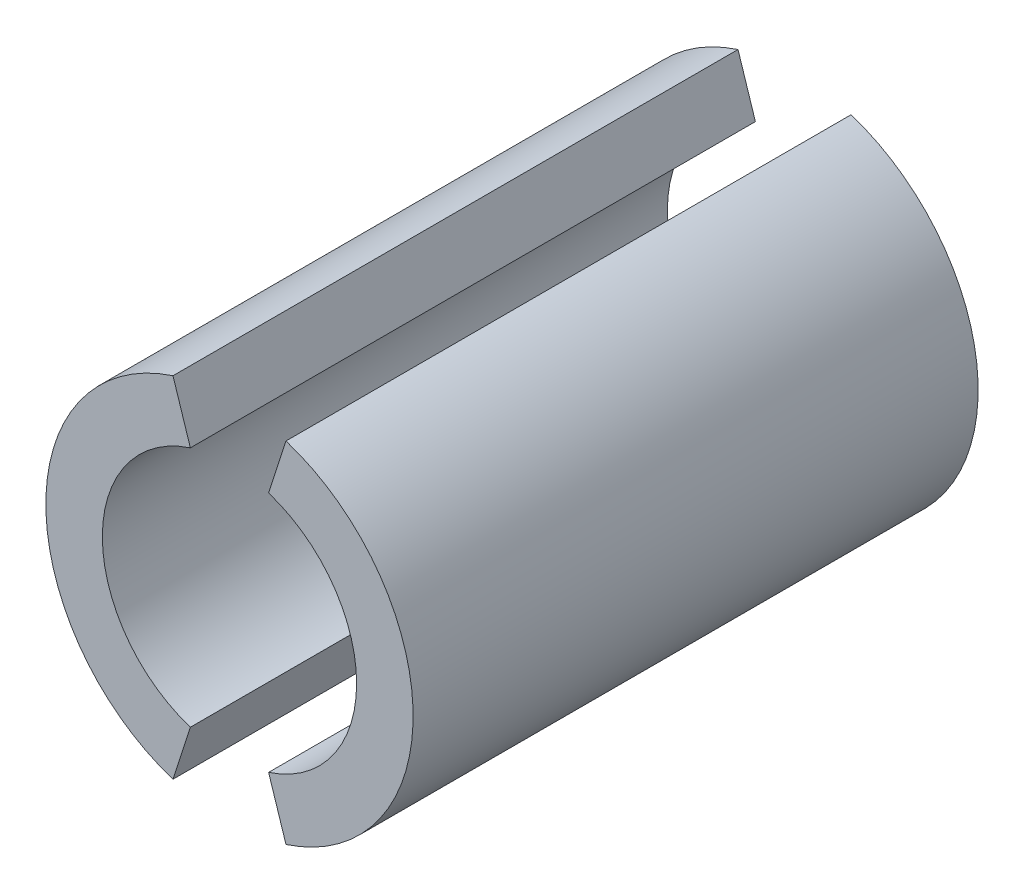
ISO-10303-21;
HEADER;
FILE_DESCRIPTION(('STEP AP214'),'2;1');
FILE_NAME('part.step','',(''),(''),'','','');
FILE_SCHEMA(('AUTOMOTIVE_DESIGN { 1 0 10303 214 1 1 1 1 }'));
ENDSEC;
DATA;
#1=APPLICATION_CONTEXT('core data for automotive mechanical design processes');
#2=APPLICATION_PROTOCOL_DEFINITION('international standard','automotive_design',2000,#1);
#3=PRODUCT_CONTEXT('',#1,'mechanical');
#4=PRODUCT('Part','Part','',(#3));
#5=PRODUCT_RELATED_PRODUCT_CATEGORY('part','',(#4));
#6=PRODUCT_DEFINITION_FORMATION('','',#4);
#7=PRODUCT_DEFINITION_CONTEXT('part definition',#1,'design');
#8=PRODUCT_DEFINITION('design','',#6,#7);
#9=PRODUCT_DEFINITION_SHAPE('','',#8);
#10=(LENGTH_UNIT() NAMED_UNIT(*) SI_UNIT(.MILLI.,.METRE.));
#11=(NAMED_UNIT(*) PLANE_ANGLE_UNIT() SI_UNIT($,.RADIAN.));
#12=(NAMED_UNIT(*) SI_UNIT($,.STERADIAN.) SOLID_ANGLE_UNIT());
#13=UNCERTAINTY_MEASURE_WITH_UNIT(LENGTH_MEASURE(1.E-05),#10,'distance_accuracy_value','');
#14=(GEOMETRIC_REPRESENTATION_CONTEXT(3) GLOBAL_UNCERTAINTY_ASSIGNED_CONTEXT((#13)) GLOBAL_UNIT_ASSIGNED_CONTEXT((#10,
#11,#12)) REPRESENTATION_CONTEXT('',''));
#15=CARTESIAN_POINT('',(0.,0.,0.));
#16=DIRECTION('',(0.,0.,1.));
#17=DIRECTION('',(1.,0.,0.));
#18=AXIS2_PLACEMENT_3D('',#15,#16,#17);
#19=CARTESIAN_POINT('',(0.,0.,-31.75));
#20=DIRECTION('',(0.,0.,1.));
#21=DIRECTION('',(1.,0.,0.));
#22=AXIS2_PLACEMENT_3D('',#19,#20,#21);
#23=CYLINDRICAL_SURFACE('',#22,14.2875);
#24=DIRECTION('',(0.,0.,1.));
#25=VECTOR('',#24,1.);
#26=CARTESIAN_POINT('',(4.39615384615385,-13.5943549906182,-31.75));
#27=LINE('',#26,#25);
#28=CARTESIAN_POINT('',(4.39615384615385,-13.5943549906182,-31.75));
#29=VERTEX_POINT('',#28);
#30=CARTESIAN_POINT('',(4.39615384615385,-13.5943549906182,31.75));
#31=VERTEX_POINT('',#30);
#32=EDGE_CURVE('E43',#29,#31,#27,.T.);
#33=ORIENTED_EDGE('',*,*,#32,.T.);
#34=CARTESIAN_POINT('',(0.,0.,31.75));
#35=DIRECTION('',(0.,0.,-1.));
#36=DIRECTION('',(1.,0.,0.));
#37=AXIS2_PLACEMENT_3D('',#34,#35,#36);
#38=CIRCLE('',#37,14.2875);
#39=CARTESIAN_POINT('',(4.39615384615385,13.5943549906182,31.75));
#40=VERTEX_POINT('',#39);
#41=EDGE_CURVE('E80',#40,#31,#38,.T.);
#42=ORIENTED_EDGE('',*,*,#41,.F.);
#43=DIRECTION('',(0.,0.,1.));
#44=VECTOR('',#43,1.);
#45=CARTESIAN_POINT('',(4.39615384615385,13.5943549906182,-31.75));
#46=LINE('',#45,#44);
#47=CARTESIAN_POINT('',(4.39615384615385,13.5943549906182,-31.75));
#48=VERTEX_POINT('',#47);
#49=EDGE_CURVE('E12',#48,#40,#46,.T.);
#50=ORIENTED_EDGE('',*,*,#49,.F.);
#51=CARTESIAN_POINT('',(0.,0.,-31.75));
#52=DIRECTION('',(0.,0.,-1.));
#53=DIRECTION('',(1.,0.,0.));
#54=AXIS2_PLACEMENT_3D('',#51,#52,#53);
#55=CIRCLE('',#54,14.2875);
#56=EDGE_CURVE('E81',#48,#29,#55,.T.);
#57=ORIENTED_EDGE('',*,*,#56,.T.);
#58=EDGE_LOOP('',(#33,#42,#50,#57));
#59=FACE_BOUND('',#58,.T.);
#60=ADVANCED_FACE('F40',(#59),#23,.F.);
#61=CARTESIAN_POINT('',(4.39615384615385,13.5943549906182,-31.75));
#62=DIRECTION('',(-0.951485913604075,0.307692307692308,0.));
#63=DIRECTION('',(-0.307692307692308,-0.951485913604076,0.));
#64=AXIS2_PLACEMENT_3D('',#61,#62,#63);
#65=PLANE('',#64);
#66=ORIENTED_EDGE('',*,*,#49,.T.);
#67=DIRECTION('',(-0.307692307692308,-0.951485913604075,0.));
#68=VECTOR('',#67,1.);
#69=CARTESIAN_POINT('',(4.39615384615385,13.5943549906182,31.75));
#70=LINE('',#69,#68);
#71=CARTESIAN_POINT('',(6.34999999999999,19.6362905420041,31.75));
#72=VERTEX_POINT('',#71);
#73=EDGE_CURVE('E97',#72,#40,#70,.T.);
#74=ORIENTED_EDGE('',*,*,#73,.F.);
#75=DIRECTION('',(0.,0.,1.));
#76=VECTOR('',#75,1.);
#77=CARTESIAN_POINT('',(6.34999999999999,19.6362905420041,-31.75));
#78=LINE('',#77,#76);
#79=CARTESIAN_POINT('',(6.34999999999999,19.6362905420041,-31.75));
#80=VERTEX_POINT('',#79);
#81=EDGE_CURVE('E48',#80,#72,#78,.T.);
#82=ORIENTED_EDGE('',*,*,#81,.F.);
#83=DIRECTION('',(-0.307692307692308,-0.951485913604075,0.));
#84=VECTOR('',#83,1.);
#85=CARTESIAN_POINT('',(4.39615384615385,13.5943549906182,-31.75));
#86=LINE('',#85,#84);
#87=EDGE_CURVE('E86',#80,#48,#86,.T.);
#88=ORIENTED_EDGE('',*,*,#87,.T.);
#89=EDGE_LOOP('',(#66,#74,#82,#88));
#90=FACE_BOUND('',#89,.T.);
#91=ADVANCED_FACE('F112',(#90),#65,.T.);
#92=CARTESIAN_POINT('',(0.,0.,-31.75));
#93=DIRECTION('',(0.,0.,1.));
#94=DIRECTION('',(1.,0.,0.));
#95=AXIS2_PLACEMENT_3D('',#92,#93,#94);
#96=CYLINDRICAL_SURFACE('',#95,20.6375);
#97=ORIENTED_EDGE('',*,*,#81,.T.);
#98=CARTESIAN_POINT('',(0.,0.,31.75));
#99=DIRECTION('',(0.,0.,1.));
#100=DIRECTION('',(1.,0.,0.));
#101=AXIS2_PLACEMENT_3D('',#98,#99,#100);
#102=CIRCLE('',#101,20.6375);
#103=CARTESIAN_POINT('',(6.35,-19.6362905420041,31.75));
#104=VERTEX_POINT('',#103);
#105=EDGE_CURVE('E93',#104,#72,#102,.T.);
#106=ORIENTED_EDGE('',*,*,#105,.F.);
#107=DIRECTION('',(0.,0.,1.));
#108=VECTOR('',#107,1.);
#109=CARTESIAN_POINT('',(6.35,-19.6362905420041,-31.75));
#110=LINE('',#109,#108);
#111=CARTESIAN_POINT('',(6.35,-19.6362905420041,-31.75));
#112=VERTEX_POINT('',#111);
#113=EDGE_CURVE('E85',#112,#104,#110,.T.);
#114=ORIENTED_EDGE('',*,*,#113,.F.);
#115=CARTESIAN_POINT('',(0.,0.,-31.75));
#116=DIRECTION('',(0.,0.,1.));
#117=DIRECTION('',(1.,0.,0.));
#118=AXIS2_PLACEMENT_3D('',#115,#116,#117);
#119=CIRCLE('',#118,20.6375);
#120=EDGE_CURVE('E105',#112,#80,#119,.T.);
#121=ORIENTED_EDGE('',*,*,#120,.T.);
#122=EDGE_LOOP('',(#97,#106,#114,#121));
#123=FACE_BOUND('',#122,.T.);
#124=ADVANCED_FACE('F109',(#123),#96,.T.);
#125=CARTESIAN_POINT('',(4.39615384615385,-13.5943549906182,-31.75));
#126=DIRECTION('',(-0.951485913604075,-0.307692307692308,0.));
#127=DIRECTION('',(0.307692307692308,-0.951485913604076,0.));
#128=AXIS2_PLACEMENT_3D('',#125,#126,#127);
#129=PLANE('',#128);
#130=ORIENTED_EDGE('',*,*,#113,.T.);
#131=DIRECTION('',(0.307692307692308,-0.951485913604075,0.));
#132=VECTOR('',#131,1.);
#133=CARTESIAN_POINT('',(4.39615384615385,-13.5943549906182,31.75));
#134=LINE('',#133,#132);
#135=EDGE_CURVE('E88',#31,#104,#134,.T.);
#136=ORIENTED_EDGE('',*,*,#135,.F.);
#137=ORIENTED_EDGE('',*,*,#32,.F.);
#138=DIRECTION('',(0.307692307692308,-0.951485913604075,0.));
#139=VECTOR('',#138,1.);
#140=CARTESIAN_POINT('',(4.39615384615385,-13.5943549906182,-31.75));
#141=LINE('',#140,#139);
#142=EDGE_CURVE('E103',#29,#112,#141,.T.);
#143=ORIENTED_EDGE('',*,*,#142,.T.);
#144=EDGE_LOOP('',(#130,#136,#137,#143));
#145=FACE_BOUND('',#144,.T.);
#146=ADVANCED_FACE('F89',(#145),#129,.T.);
#147=CARTESIAN_POINT('',(0.,0.,-31.75));
#148=DIRECTION('',(0.,0.,1.));
#149=DIRECTION('',(1.,0.,0.));
#150=AXIS2_PLACEMENT_3D('',#147,#148,#149);
#151=PLANE('',#150);
#152=ORIENTED_EDGE('',*,*,#56,.F.);
#153=ORIENTED_EDGE('',*,*,#87,.F.);
#154=ORIENTED_EDGE('',*,*,#120,.F.);
#155=ORIENTED_EDGE('',*,*,#142,.F.);
#156=EDGE_LOOP('',(#152,#153,#154,#155));
#157=FACE_BOUND('',#156,.T.);
#158=ADVANCED_FACE('F114',(#157),#151,.F.);
#159=CARTESIAN_POINT('',(0.,0.,31.75));
#160=DIRECTION('',(0.,0.,1.));
#161=DIRECTION('',(1.,0.,0.));
#162=AXIS2_PLACEMENT_3D('',#159,#160,#161);
#163=PLANE('',#162);
#164=ORIENTED_EDGE('',*,*,#41,.T.);
#165=ORIENTED_EDGE('',*,*,#135,.T.);
#166=ORIENTED_EDGE('',*,*,#105,.T.);
#167=ORIENTED_EDGE('',*,*,#73,.T.);
#168=EDGE_LOOP('',(#164,#165,#166,#167));
#169=FACE_BOUND('',#168,.T.);
#170=ADVANCED_FACE('F96',(#169),#163,.T.);
#171=CLOSED_SHELL('',(#60,#91,#124,#146,#158,#170));
#172=MANIFOLD_SOLID_BREP('B2',#171);
#173=CARTESIAN_POINT('',(0.,0.,-31.75));
#174=DIRECTION('',(0.,0.,1.));
#175=DIRECTION('',(1.,0.,0.));
#176=AXIS2_PLACEMENT_3D('',#173,#174,#175);
#177=CYLINDRICAL_SURFACE('',#176,20.6375);
#178=DIRECTION('',(0.,0.,1.));
#179=VECTOR('',#178,1.);
#180=CARTESIAN_POINT('',(-6.35,-19.6362905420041,-31.75));
#181=LINE('',#180,#179);
#182=CARTESIAN_POINT('',(-6.35,-19.6362905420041,-31.75));
#183=VERTEX_POINT('',#182);
#184=CARTESIAN_POINT('',(-6.35,-19.6362905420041,31.75));
#185=VERTEX_POINT('',#184);
#186=EDGE_CURVE('E166',#183,#185,#181,.T.);
#187=ORIENTED_EDGE('',*,*,#186,.T.);
#188=CARTESIAN_POINT('',(0.,0.,31.75));
#189=DIRECTION('',(0.,0.,1.));
#190=DIRECTION('',(1.,0.,0.));
#191=AXIS2_PLACEMENT_3D('',#188,#189,#190);
#192=CIRCLE('',#191,20.6375);
#193=CARTESIAN_POINT('',(-6.35,19.6362905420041,31.75));
#194=VERTEX_POINT('',#193);
#195=EDGE_CURVE('E203',#194,#185,#192,.T.);
#196=ORIENTED_EDGE('',*,*,#195,.F.);
#197=DIRECTION('',(0.,0.,1.));
#198=VECTOR('',#197,1.);
#199=CARTESIAN_POINT('',(-6.35,19.6362905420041,-31.75));
#200=LINE('',#199,#198);
#201=CARTESIAN_POINT('',(-6.35,19.6362905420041,-31.75));
#202=VERTEX_POINT('',#201);
#203=EDGE_CURVE('E38',#202,#194,#200,.T.);
#204=ORIENTED_EDGE('',*,*,#203,.F.);
#205=CARTESIAN_POINT('',(0.,0.,-31.75));
#206=DIRECTION('',(0.,0.,1.));
#207=DIRECTION('',(1.,0.,0.));
#208=AXIS2_PLACEMENT_3D('',#205,#206,#207);
#209=CIRCLE('',#208,20.6375);
#210=EDGE_CURVE('E204',#202,#183,#209,.T.);
#211=ORIENTED_EDGE('',*,*,#210,.T.);
#212=EDGE_LOOP('',(#187,#196,#204,#211));
#213=FACE_BOUND('',#212,.T.);
#214=ADVANCED_FACE('F163',(#213),#177,.T.);
#215=CARTESIAN_POINT('',(-6.35,19.6362905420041,-31.75));
#216=DIRECTION('',(0.951485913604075,0.307692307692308,0.));
#217=DIRECTION('',(-0.307692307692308,0.951485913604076,0.));
#218=AXIS2_PLACEMENT_3D('',#215,#216,#217);
#219=PLANE('',#218);
#220=ORIENTED_EDGE('',*,*,#203,.T.);
#221=DIRECTION('',(-0.307692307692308,0.951485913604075,0.));
#222=VECTOR('',#221,1.);
#223=CARTESIAN_POINT('',(-6.35,19.6362905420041,31.75));
#224=LINE('',#223,#222);
#225=CARTESIAN_POINT('',(-4.39615384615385,13.5943549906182,31.75));
#226=VERTEX_POINT('',#225);
#227=EDGE_CURVE('E220',#226,#194,#224,.T.);
#228=ORIENTED_EDGE('',*,*,#227,.F.);
#229=DIRECTION('',(0.,0.,1.));
#230=VECTOR('',#229,1.);
#231=CARTESIAN_POINT('',(-4.39615384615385,13.5943549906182,-31.75));
#232=LINE('',#231,#230);
#233=CARTESIAN_POINT('',(-4.39615384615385,13.5943549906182,-31.75));
#234=VERTEX_POINT('',#233);
#235=EDGE_CURVE('E171',#234,#226,#232,.T.);
#236=ORIENTED_EDGE('',*,*,#235,.F.);
#237=DIRECTION('',(-0.307692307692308,0.951485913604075,0.));
#238=VECTOR('',#237,1.);
#239=CARTESIAN_POINT('',(-6.35,19.6362905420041,-31.75));
#240=LINE('',#239,#238);
#241=EDGE_CURVE('E209',#234,#202,#240,.T.);
#242=ORIENTED_EDGE('',*,*,#241,.T.);
#243=EDGE_LOOP('',(#220,#228,#236,#242));
#244=FACE_BOUND('',#243,.T.);
#245=ADVANCED_FACE('F235',(#244),#219,.T.);
#246=CARTESIAN_POINT('',(0.,0.,-31.75));
#247=DIRECTION('',(0.,0.,1.));
#248=DIRECTION('',(1.,0.,0.));
#249=AXIS2_PLACEMENT_3D('',#246,#247,#248);
#250=CYLINDRICAL_SURFACE('',#249,14.2875);
#251=ORIENTED_EDGE('',*,*,#235,.T.);
#252=CARTESIAN_POINT('',(0.,0.,31.75));
#253=DIRECTION('',(0.,0.,-1.));
#254=DIRECTION('',(1.,0.,0.));
#255=AXIS2_PLACEMENT_3D('',#252,#253,#254);
#256=CIRCLE('',#255,14.2875);
#257=CARTESIAN_POINT('',(-4.39615384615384,-13.5943549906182,31.75));
#258=VERTEX_POINT('',#257);
#259=EDGE_CURVE('E216',#258,#226,#256,.T.);
#260=ORIENTED_EDGE('',*,*,#259,.F.);
#261=DIRECTION('',(0.,0.,1.));
#262=VECTOR('',#261,1.);
#263=CARTESIAN_POINT('',(-4.39615384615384,-13.5943549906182,-31.75));
#264=LINE('',#263,#262);
#265=CARTESIAN_POINT('',(-4.39615384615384,-13.5943549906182,-31.75));
#266=VERTEX_POINT('',#265);
#267=EDGE_CURVE('E208',#266,#258,#264,.T.);
#268=ORIENTED_EDGE('',*,*,#267,.F.);
#269=CARTESIAN_POINT('',(0.,0.,-31.75));
#270=DIRECTION('',(0.,0.,-1.));
#271=DIRECTION('',(1.,0.,0.));
#272=AXIS2_PLACEMENT_3D('',#269,#270,#271);
#273=CIRCLE('',#272,14.2875);
#274=EDGE_CURVE('E228',#266,#234,#273,.T.);
#275=ORIENTED_EDGE('',*,*,#274,.T.);
#276=EDGE_LOOP('',(#251,#260,#268,#275));
#277=FACE_BOUND('',#276,.T.);
#278=ADVANCED_FACE('F232',(#277),#250,.F.);
#279=CARTESIAN_POINT('',(-6.35,-19.6362905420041,-31.75));
#280=DIRECTION('',(0.951485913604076,-0.307692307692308,0.));
#281=DIRECTION('',(0.307692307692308,0.951485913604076,0.));
#282=AXIS2_PLACEMENT_3D('',#279,#280,#281);
#283=PLANE('',#282);
#284=ORIENTED_EDGE('',*,*,#267,.T.);
#285=DIRECTION('',(0.307692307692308,0.951485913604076,0.));
#286=VECTOR('',#285,1.);
#287=CARTESIAN_POINT('',(-6.35,-19.6362905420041,31.75));
#288=LINE('',#287,#286);
#289=EDGE_CURVE('E211',#185,#258,#288,.T.);
#290=ORIENTED_EDGE('',*,*,#289,.F.);
#291=ORIENTED_EDGE('',*,*,#186,.F.);
#292=DIRECTION('',(0.307692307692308,0.951485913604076,0.));
#293=VECTOR('',#292,1.);
#294=CARTESIAN_POINT('',(-6.35,-19.6362905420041,-31.75));
#295=LINE('',#294,#293);
#296=EDGE_CURVE('E226',#183,#266,#295,.T.);
#297=ORIENTED_EDGE('',*,*,#296,.T.);
#298=EDGE_LOOP('',(#284,#290,#291,#297));
#299=FACE_BOUND('',#298,.T.);
#300=ADVANCED_FACE('F212',(#299),#283,.T.);
#301=CARTESIAN_POINT('',(0.,0.,-31.75));
#302=DIRECTION('',(0.,0.,1.));
#303=DIRECTION('',(1.,0.,0.));
#304=AXIS2_PLACEMENT_3D('',#301,#302,#303);
#305=PLANE('',#304);
#306=ORIENTED_EDGE('',*,*,#210,.F.);
#307=ORIENTED_EDGE('',*,*,#241,.F.);
#308=ORIENTED_EDGE('',*,*,#274,.F.);
#309=ORIENTED_EDGE('',*,*,#296,.F.);
#310=EDGE_LOOP('',(#306,#307,#308,#309));
#311=FACE_BOUND('',#310,.T.);
#312=ADVANCED_FACE('F237',(#311),#305,.F.);
#313=CARTESIAN_POINT('',(0.,0.,31.75));
#314=DIRECTION('',(0.,0.,1.));
#315=DIRECTION('',(1.,0.,0.));
#316=AXIS2_PLACEMENT_3D('',#313,#314,#315);
#317=PLANE('',#316);
#318=ORIENTED_EDGE('',*,*,#195,.T.);
#319=ORIENTED_EDGE('',*,*,#289,.T.);
#320=ORIENTED_EDGE('',*,*,#259,.T.);
#321=ORIENTED_EDGE('',*,*,#227,.T.);
#322=EDGE_LOOP('',(#318,#319,#320,#321));
#323=FACE_BOUND('',#322,.T.);
#324=ADVANCED_FACE('F219',(#323),#317,.T.);
#325=CLOSED_SHELL('',(#214,#245,#278,#300,#312,#324));
#326=MANIFOLD_SOLID_BREP('B6',#325);
#327=ADVANCED_BREP_SHAPE_REPRESENTATION('',(#18,#172,#326),#14);
#328=SHAPE_DEFINITION_REPRESENTATION(#9,#327);
ENDSEC;
END-ISO-10303-21;
